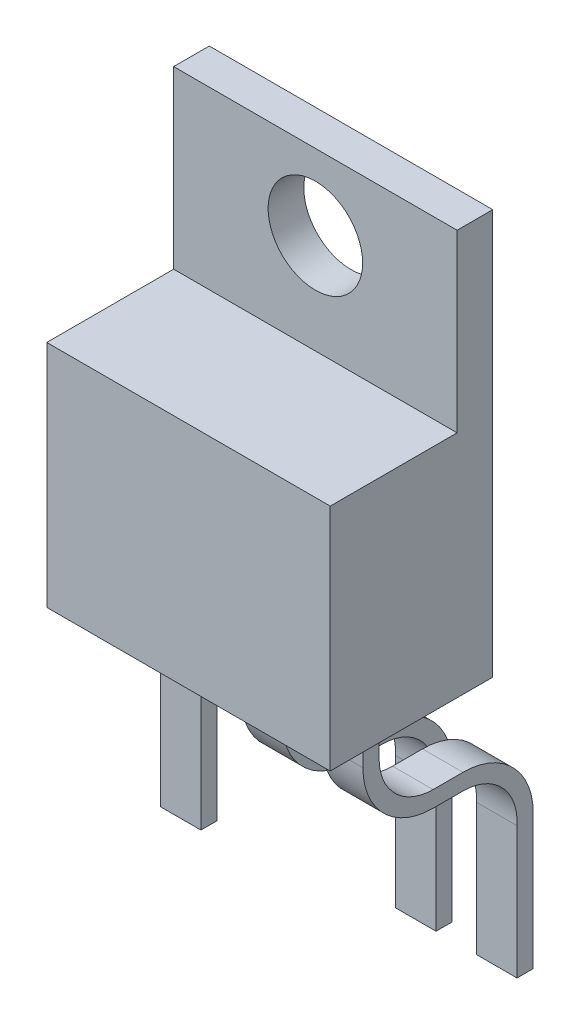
from build123d import *

# Parameters (mm, degrees)
SKETCH_1_W          = 10.5
SKETCH_1_H          = 15
SKETCH_1_R          = 1.75
EXTRUDE_1_DEPTH     = 1.32
SKETCH_2_W          = 10.5
SKETCH_2_H          = 8.5
EXTRUDE_2_DEPTH     = 4.7
EXTRUDE_3_DEPTH     = 10.5
SKETCH_4_W          = 1.5
SKETCH_4_H          = 11.6
CUT_EXTRUDE_1_DEPTH = 20.36662335
CUT_EXTRUDE_2_REACH = 20.5
SKETCH_5_W          = 6.31
SKETCH_5_H          = 9.6
SKETCH_6_W          = 1.5
SKETCH_6_H          = 0.6
EXTRUDE_4_DEPTH     = 5


with BuildPart() as part:
    # Sketch 1 → Extrude 1 (new body)
    with BuildSketch(Plane.XY):
        with Locations((5.25, 7.5)):
            Rectangle(SKETCH_1_W, SKETCH_1_H)
        with Locations((5.25, 12.2)):
            Circle(SKETCH_1_R, mode=Mode.SUBTRACT)
    extrude(amount=EXTRUDE_1_DEPTH)

    # Sketch 2 → Extrude 2 (add)
    with BuildSketch(Plane.XY.offset(1.32)):
        with Locations((5.25, 4.25)):
            Rectangle(SKETCH_2_W, SKETCH_2_H)
    extrude(amount=EXTRUDE_2_DEPTH)

    # Sketch 3 → Extrude 3 (add)
    with BuildSketch(Plane(origin=(10.5, 0, 0), x_dir=(0, 0, -1), z_dir=(1, 0, 0))):
        with BuildLine():
            Line((-2.71, -2), (-2.71, 0))
            Line((-2.71, 0), (-3.31, 0))
            Line((-3.31, 0), (-3.31, -2))
            ThreePointArc((-3.31, -2), (-2.548477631, -3.838477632), (-0.709999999, -4.6))
            Line((-0.709999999, -4.6), (0.4, -4.6))
            ThreePointArc((0.4, -4.6), (1.853639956, -5.225038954), (2.4, -6.710041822))
            Line((2.4, -6.710041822), (2.4, -11.6))
            Line((2.4, -11.6), (3, -11.6))
            Line((3, -11.6), (3, -6.6))
            ThreePointArc((3, -6.6), (2.238477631, -4.761522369), (0.4, -4))
            Line((0.4, -4), (-0.71, -4))
            ThreePointArc((-0.71, -4), (-2.124213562, -3.414213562), (-2.71, -2))
        make_face()
    extrude(amount=-EXTRUDE_3_DEPTH)

    # Sketch 4 → Cut-Extrude 1 (cut, through all)
    with BuildSketch(Plane.XY.offset(3.31)):
        with Locations((6.75, -5.8)):
            Rectangle(SKETCH_4_W, SKETCH_4_H)
        with Locations((0.75, -5.8)):
            Rectangle(SKETCH_4_W, SKETCH_4_H)
        with Locations((9.75, -5.8)):
            Rectangle(SKETCH_4_W, SKETCH_4_H)
        with Locations((3.75, -5.8)):
            Rectangle(SKETCH_4_W, SKETCH_4_H)
    extrude(amount=-CUT_EXTRUDE_1_DEPTH, mode=Mode.SUBTRACT)

    # Sketch 5 → Cut-Extrude 2 (cut, up to next)
    with BuildSketch(Plane.ZY.offset(-1.5), mode=Mode.PRIVATE) as cut_extrude_2_sk1:
        with Locations((0.155, -6.8)):
            Rectangle(SKETCH_5_W, SKETCH_5_H)
    cut_extrude_2_tool1 = extrude(cut_extrude_2_sk1.sketch, amount=-CUT_EXTRUDE_2_REACH, mode=Mode.PRIVATE) & part.part
    add(cut_extrude_2_tool1.solids().sort_by_distance((1.5, -6.8, 0.155))[0], mode=Mode.SUBTRACT)

    # Sketch 6 → Extrude 4 (add)
    with BuildSketch(Plane.XZ.offset(2)):
        with Locations((2.25, 3.01)):
            Rectangle(SKETCH_6_W, SKETCH_6_H)
    extrude(amount=EXTRUDE_4_DEPTH)


solid = part.part
